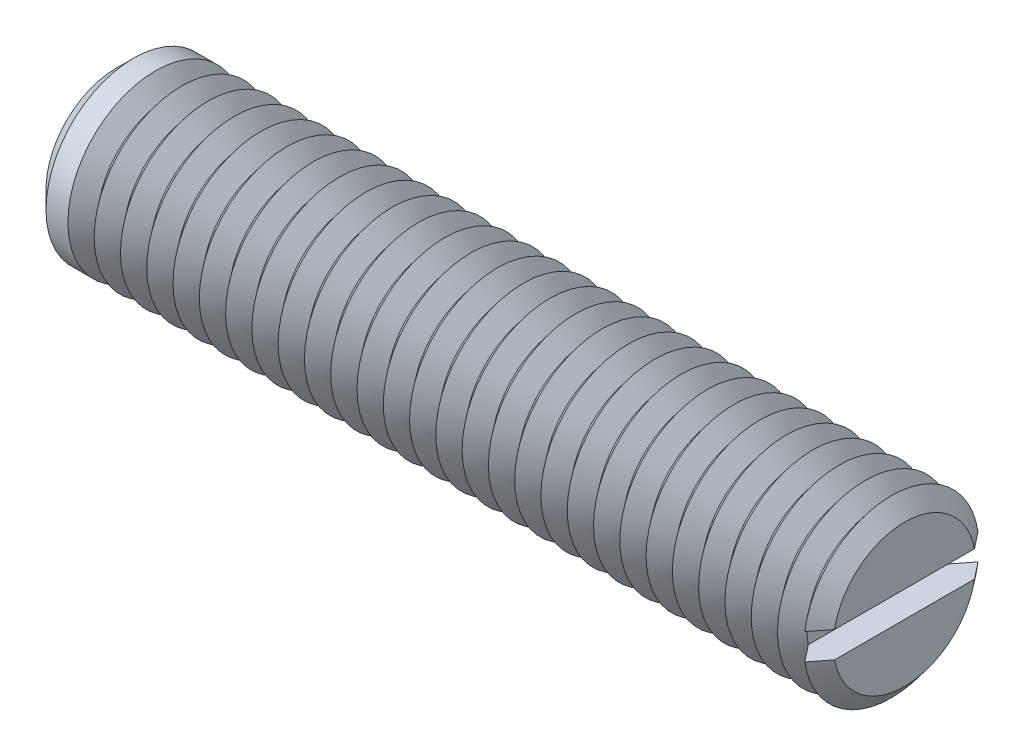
from build123d import *

# Parameters (mm, degrees)
SKETCH1_R       = 5
EXTRUDE1_DEPTH  = 22.5
SKETCH2_W       = 1.5
SKETCH2_H       = 1.5
EXTRUDE2_DEPTH  = 7.5
CHAMFER1_SIZE   = 1
LPATTERN1_COUNT = 29
LPATTERN1_PITCH = 1.5


with BuildPart() as part:
    # Sketch1 → Extrude1 (new, symmetric)
    with BuildSketch(Plane(origin=(0, 0, 0), x_dir=(0, 0, -1), z_dir=(1, 0, 0))):
        with Locations(Location((0, 0, 0), (0, 0, 180))):
            Circle(SKETCH1_R)
    extrude(amount=EXTRUDE1_DEPTH, both=True)

    # Sketch2 → Extrude2 (cut, symmetric)
    with BuildSketch(Plane.XY):
        with Locations((21.75, 0)):
            Rectangle(SKETCH2_W, SKETCH2_H)
    extrude(amount=EXTRUDE2_DEPTH, both=True, mode=Mode.SUBTRACT)

    # Chamfer1
    chamfer1_edges = [part.edges().sort_by_distance(p)[0] for p in [
        (-22.5, 0, -5),
    ]]
    chamfer(chamfer1_edges, length=CHAMFER1_SIZE)

    # Sketch3 → Cut-Revolve1 (revolve, cut)
    with BuildSketch(Plane.XY, mode=Mode.PRIVATE) as cut_revolve1_sk:
        Polygon((21.75, -5), (23.25, -5), (22.5, -4.0632503), align=None)
    cut_revolve1 = revolve(cut_revolve1_sk.sketch.rotate(Axis((0, 0, 0), (1, 0, 0)), 261.373073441), axis=Axis((0, 0, 0), (1, 0, 0)), mode=Mode.SUBTRACT)

    # LPattern1: Cut-Revolve1 ×29
    with Locations(*[(-i * LPATTERN1_PITCH, 0, 0) for i in range(1, LPATTERN1_COUNT)]):
        add(cut_revolve1, mode=Mode.SUBTRACT)


solid = part.part
